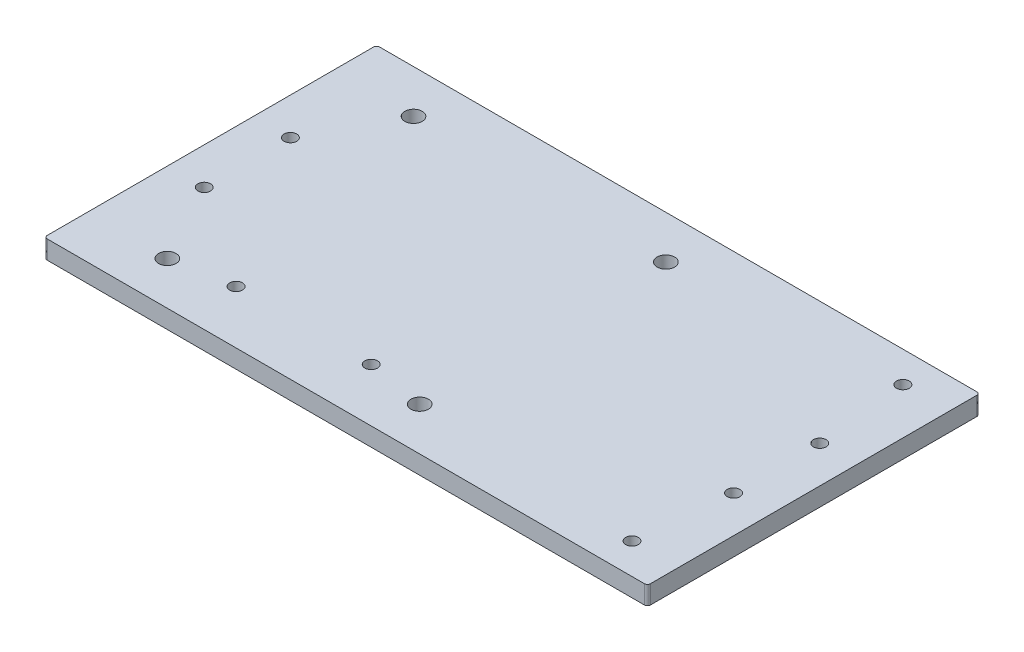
ISO-10303-21;
HEADER;
FILE_DESCRIPTION(('STEP AP214'),'2;1');
FILE_NAME('part.step','',(''),(''),'','','');
FILE_SCHEMA(('AUTOMOTIVE_DESIGN { 1 0 10303 214 1 1 1 1 }'));
ENDSEC;
DATA;
#1=APPLICATION_CONTEXT('core data for automotive mechanical design processes');
#2=APPLICATION_PROTOCOL_DEFINITION('international standard','automotive_design',2000,#1);
#3=PRODUCT_CONTEXT('',#1,'mechanical');
#4=PRODUCT('Part','Part','',(#3));
#5=PRODUCT_RELATED_PRODUCT_CATEGORY('part','',(#4));
#6=PRODUCT_DEFINITION_FORMATION('','',#4);
#7=PRODUCT_DEFINITION_CONTEXT('part definition',#1,'design');
#8=PRODUCT_DEFINITION('design','',#6,#7);
#9=PRODUCT_DEFINITION_SHAPE('','',#8);
#10=(LENGTH_UNIT() NAMED_UNIT(*) SI_UNIT(.MILLI.,.METRE.));
#11=(NAMED_UNIT(*) PLANE_ANGLE_UNIT() SI_UNIT($,.RADIAN.));
#12=(NAMED_UNIT(*) SI_UNIT($,.STERADIAN.) SOLID_ANGLE_UNIT());
#13=UNCERTAINTY_MEASURE_WITH_UNIT(LENGTH_MEASURE(1.E-05),#10,'distance_accuracy_value','');
#14=(GEOMETRIC_REPRESENTATION_CONTEXT(3) GLOBAL_UNCERTAINTY_ASSIGNED_CONTEXT((#13)) GLOBAL_UNIT_ASSIGNED_CONTEXT((#10,
#11,#12)) REPRESENTATION_CONTEXT('',''));
#15=CARTESIAN_POINT('',(0.,0.,0.));
#16=DIRECTION('',(0.,0.,1.));
#17=DIRECTION('',(1.,0.,0.));
#18=AXIS2_PLACEMENT_3D('',#15,#16,#17);
#19=CARTESIAN_POINT('',(49.,3.,-27.));
#20=DIRECTION('',(-1.,0.,0.));
#21=DIRECTION('',(0.,0.,1.));
#22=AXIS2_PLACEMENT_3D('',#19,#20,#21);
#23=PLANE('',#22);
#24=DIRECTION('',(0.,0.,-1.));
#25=VECTOR('',#24,1.);
#26=CARTESIAN_POINT('',(49.,0.,-27.));
#27=LINE('',#26,#25);
#28=CARTESIAN_POINT('',(49.,0.,26.5));
#29=VERTEX_POINT('',#28);
#30=CARTESIAN_POINT('',(49.,0.,-26.5));
#31=VERTEX_POINT('',#30);
#32=EDGE_CURVE('E137',#29,#31,#27,.T.);
#33=ORIENTED_EDGE('',*,*,#32,.T.);
#34=DIRECTION('',(0.,-1.,0.));
#35=VECTOR('',#34,1.);
#36=CARTESIAN_POINT('',(49.,3.,-26.5));
#37=LINE('',#36,#35);
#38=CARTESIAN_POINT('',(49.,3.,-26.5));
#39=VERTEX_POINT('',#38);
#40=EDGE_CURVE('E112',#31,#39,#37,.F.);
#41=ORIENTED_EDGE('',*,*,#40,.T.);
#42=DIRECTION('',(0.,0.,-1.));
#43=VECTOR('',#42,1.);
#44=CARTESIAN_POINT('',(49.,3.,-27.));
#45=LINE('',#44,#43);
#46=CARTESIAN_POINT('',(49.,3.,26.5));
#47=VERTEX_POINT('',#46);
#48=EDGE_CURVE('E150',#47,#39,#45,.T.);
#49=ORIENTED_EDGE('',*,*,#48,.F.);
#50=DIRECTION('',(0.,-1.,0.));
#51=VECTOR('',#50,1.);
#52=CARTESIAN_POINT('',(49.,3.,26.5));
#53=LINE('',#52,#51);
#54=EDGE_CURVE('E118',#47,#29,#53,.T.);
#55=ORIENTED_EDGE('',*,*,#54,.T.);
#56=EDGE_LOOP('',(#33,#41,#49,#55));
#57=FACE_BOUND('',#56,.T.);
#58=ADVANCED_FACE('F40',(#57),#23,.F.);
#59=CARTESIAN_POINT('',(-49.,3.,-27.));
#60=DIRECTION('',(0.,0.,1.));
#61=DIRECTION('',(1.,0.,0.));
#62=AXIS2_PLACEMENT_3D('',#59,#60,#61);
#63=PLANE('',#62);
#64=DIRECTION('',(-1.,0.,0.));
#65=VECTOR('',#64,1.);
#66=CARTESIAN_POINT('',(-49.,3.,-27.));
#67=LINE('',#66,#65);
#68=CARTESIAN_POINT('',(48.5,3.,-27.));
#69=VERTEX_POINT('',#68);
#70=CARTESIAN_POINT('',(-48.5,3.,-27.));
#71=VERTEX_POINT('',#70);
#72=EDGE_CURVE('E128',#69,#71,#67,.T.);
#73=ORIENTED_EDGE('',*,*,#72,.F.);
#74=DIRECTION('',(0.,-1.,0.));
#75=VECTOR('',#74,1.);
#76=CARTESIAN_POINT('',(48.5,3.,-27.));
#77=LINE('',#76,#75);
#78=CARTESIAN_POINT('',(48.5,0.,-27.));
#79=VERTEX_POINT('',#78);
#80=EDGE_CURVE('E111',#69,#79,#77,.T.);
#81=ORIENTED_EDGE('',*,*,#80,.T.);
#82=DIRECTION('',(-1.,0.,0.));
#83=VECTOR('',#82,1.);
#84=CARTESIAN_POINT('',(-49.,0.,-27.));
#85=LINE('',#84,#83);
#86=CARTESIAN_POINT('',(-48.5,0.,-27.));
#87=VERTEX_POINT('',#86);
#88=EDGE_CURVE('E125',#79,#87,#85,.T.);
#89=ORIENTED_EDGE('',*,*,#88,.T.);
#90=DIRECTION('',(0.,-1.,0.));
#91=VECTOR('',#90,1.);
#92=CARTESIAN_POINT('',(-48.5,3.,-27.));
#93=LINE('',#92,#91);
#94=EDGE_CURVE('E131',#87,#71,#93,.F.);
#95=ORIENTED_EDGE('',*,*,#94,.T.);
#96=EDGE_LOOP('',(#73,#81,#89,#95));
#97=FACE_BOUND('',#96,.T.);
#98=ADVANCED_FACE('F124',(#97),#63,.F.);
#99=CARTESIAN_POINT('',(-49.,3.,-27.));
#100=DIRECTION('',(1.,0.,0.));
#101=DIRECTION('',(0.,0.,-1.));
#102=AXIS2_PLACEMENT_3D('',#99,#100,#101);
#103=PLANE('',#102);
#104=DIRECTION('',(0.,0.,1.));
#105=VECTOR('',#104,1.);
#106=CARTESIAN_POINT('',(-49.,0.,-27.));
#107=LINE('',#106,#105);
#108=CARTESIAN_POINT('',(-49.,0.,-26.5));
#109=VERTEX_POINT('',#108);
#110=CARTESIAN_POINT('',(-49.,0.,26.5));
#111=VERTEX_POINT('',#110);
#112=EDGE_CURVE('E136',#109,#111,#107,.T.);
#113=ORIENTED_EDGE('',*,*,#112,.T.);
#114=DIRECTION('',(0.,-1.,0.));
#115=VECTOR('',#114,1.);
#116=CARTESIAN_POINT('',(-49.,3.,26.5));
#117=LINE('',#116,#115);
#118=CARTESIAN_POINT('',(-49.,3.,26.5));
#119=VERTEX_POINT('',#118);
#120=EDGE_CURVE('E11',#111,#119,#117,.F.);
#121=ORIENTED_EDGE('',*,*,#120,.T.);
#122=DIRECTION('',(0.,0.,1.));
#123=VECTOR('',#122,1.);
#124=CARTESIAN_POINT('',(-49.,3.,-27.));
#125=LINE('',#124,#123);
#126=CARTESIAN_POINT('',(-49.,3.,-26.5));
#127=VERTEX_POINT('',#126);
#128=EDGE_CURVE('E207',#127,#119,#125,.T.);
#129=ORIENTED_EDGE('',*,*,#128,.F.);
#130=DIRECTION('',(0.,-1.,0.));
#131=VECTOR('',#130,1.);
#132=CARTESIAN_POINT('',(-49.,3.,-26.5));
#133=LINE('',#132,#131);
#134=EDGE_CURVE('E49',#127,#109,#133,.T.);
#135=ORIENTED_EDGE('',*,*,#134,.T.);
#136=EDGE_LOOP('',(#113,#121,#129,#135));
#137=FACE_BOUND('',#136,.T.);
#138=ADVANCED_FACE('F205',(#137),#103,.F.);
#139=CARTESIAN_POINT('',(-49.,3.,27.));
#140=DIRECTION('',(0.,0.,-1.));
#141=DIRECTION('',(-1.,0.,0.));
#142=AXIS2_PLACEMENT_3D('',#139,#140,#141);
#143=PLANE('',#142);
#144=DIRECTION('',(1.,0.,0.));
#145=VECTOR('',#144,1.);
#146=CARTESIAN_POINT('',(-49.,0.,27.));
#147=LINE('',#146,#145);
#148=CARTESIAN_POINT('',(-48.5,0.,27.));
#149=VERTEX_POINT('',#148);
#150=CARTESIAN_POINT('',(48.5,0.,27.));
#151=VERTEX_POINT('',#150);
#152=EDGE_CURVE('E142',#149,#151,#147,.T.);
#153=ORIENTED_EDGE('',*,*,#152,.T.);
#154=DIRECTION('',(0.,-1.,0.));
#155=VECTOR('',#154,1.);
#156=CARTESIAN_POINT('',(48.5,3.,27.));
#157=LINE('',#156,#155);
#158=CARTESIAN_POINT('',(48.5,3.,27.));
#159=VERTEX_POINT('',#158);
#160=EDGE_CURVE('E56',#151,#159,#157,.F.);
#161=ORIENTED_EDGE('',*,*,#160,.T.);
#162=DIRECTION('',(1.,0.,0.));
#163=VECTOR('',#162,1.);
#164=CARTESIAN_POINT('',(-49.,3.,27.));
#165=LINE('',#164,#163);
#166=CARTESIAN_POINT('',(-48.5,3.,27.));
#167=VERTEX_POINT('',#166);
#168=EDGE_CURVE('E170',#167,#159,#165,.T.);
#169=ORIENTED_EDGE('',*,*,#168,.F.);
#170=DIRECTION('',(0.,-1.,0.));
#171=VECTOR('',#170,1.);
#172=CARTESIAN_POINT('',(-48.5,3.,27.));
#173=LINE('',#172,#171);
#174=EDGE_CURVE('E195',#167,#149,#173,.T.);
#175=ORIENTED_EDGE('',*,*,#174,.T.);
#176=EDGE_LOOP('',(#153,#161,#169,#175));
#177=FACE_BOUND('',#176,.T.);
#178=ADVANCED_FACE('F214',(#177),#143,.F.);
#179=CARTESIAN_POINT('',(0.,3.,0.));
#180=DIRECTION('',(0.,1.,0.));
#181=DIRECTION('',(0.,0.,1.));
#182=AXIS2_PLACEMENT_3D('',#179,#180,#181);
#183=PLANE('',#182);
#184=CARTESIAN_POINT('',(43.,3.,-7.));
#185=DIRECTION('',(0.,1.,0.));
#186=DIRECTION('',(0.,0.,1.));
#187=AXIS2_PLACEMENT_3D('',#184,#185,#186);
#188=CIRCLE('',#187,1.03);
#189=CARTESIAN_POINT('',(43.,3.,-5.97));
#190=VERTEX_POINT('',#189);
#191=EDGE_CURVE('E291',#190,#190,#188,.T.);
#192=ORIENTED_EDGE('',*,*,#191,.F.);
#193=EDGE_LOOP('',(#192));
#194=FACE_BOUND('',#193,.T.);
#195=CARTESIAN_POINT('',(-43.,3.,7.));
#196=DIRECTION('',(0.,1.,0.));
#197=DIRECTION('',(0.,0.,-1.));
#198=AXIS2_PLACEMENT_3D('',#195,#196,#197);
#199=CIRCLE('',#198,1.03);
#200=CARTESIAN_POINT('',(-43.,3.,5.97));
#201=VERTEX_POINT('',#200);
#202=EDGE_CURVE('E295',#201,#201,#199,.T.);
#203=ORIENTED_EDGE('',*,*,#202,.F.);
#204=EDGE_LOOP('',(#203));
#205=FACE_BOUND('',#204,.T.);
#206=CARTESIAN_POINT('',(-43.,3.,-7.));
#207=DIRECTION('',(0.,1.,0.));
#208=DIRECTION('',(0.,0.,1.));
#209=AXIS2_PLACEMENT_3D('',#206,#207,#208);
#210=CIRCLE('',#209,1.03);
#211=CARTESIAN_POINT('',(-43.,3.,-5.97));
#212=VERTEX_POINT('',#211);
#213=EDGE_CURVE('E290',#212,#212,#210,.T.);
#214=ORIENTED_EDGE('',*,*,#213,.F.);
#215=EDGE_LOOP('',(#214));
#216=FACE_BOUND('',#215,.T.);
#217=CARTESIAN_POINT('',(43.,3.,7.));
#218=DIRECTION('',(0.,1.,0.));
#219=DIRECTION('',(0.,0.,-1.));
#220=AXIS2_PLACEMENT_3D('',#217,#218,#219);
#221=CIRCLE('',#220,1.03);
#222=CARTESIAN_POINT('',(43.,3.,5.97));
#223=VERTEX_POINT('',#222);
#224=EDGE_CURVE('E156',#223,#223,#221,.T.);
#225=ORIENTED_EDGE('',*,*,#224,.F.);
#226=EDGE_LOOP('',(#225));
#227=FACE_BOUND('',#226,.T.);
#228=CARTESIAN_POINT('',(-4.52499999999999,3.,18.35));
#229=DIRECTION('',(0.,1.,0.));
#230=DIRECTION('',(0.,0.,1.));
#231=AXIS2_PLACEMENT_3D('',#228,#229,#230);
#232=CIRCLE('',#231,1.03);
#233=CARTESIAN_POINT('',(-4.52499999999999,3.,19.38));
#234=VERTEX_POINT('',#233);
#235=EDGE_CURVE('E280',#234,#234,#232,.T.);
#236=ORIENTED_EDGE('',*,*,#235,.F.);
#237=EDGE_LOOP('',(#236));
#238=FACE_BOUND('',#237,.T.);
#239=CARTESIAN_POINT('',(-26.475,3.,18.35));
#240=DIRECTION('',(0.,1.,0.));
#241=DIRECTION('',(0.,0.,-1.));
#242=AXIS2_PLACEMENT_3D('',#239,#240,#241);
#243=CIRCLE('',#242,1.03);
#244=CARTESIAN_POINT('',(-26.475,3.,17.32));
#245=VERTEX_POINT('',#244);
#246=EDGE_CURVE('E168',#245,#245,#243,.T.);
#247=ORIENTED_EDGE('',*,*,#246,.F.);
#248=EDGE_LOOP('',(#247));
#249=FACE_BOUND('',#248,.T.);
#250=CARTESIAN_POINT('',(-36.,3.,20.));
#251=DIRECTION('',(0.,1.,0.));
#252=DIRECTION('',(0.,0.,1.));
#253=AXIS2_PLACEMENT_3D('',#250,#251,#252);
#254=CIRCLE('',#253,1.42);
#255=CARTESIAN_POINT('',(-36.,3.,21.42));
#256=VERTEX_POINT('',#255);
#257=EDGE_CURVE('E258',#256,#256,#254,.T.);
#258=ORIENTED_EDGE('',*,*,#257,.F.);
#259=EDGE_LOOP('',(#258));
#260=FACE_BOUND('',#259,.T.);
#261=CARTESIAN_POINT('',(5.00000000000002,3.,-20.));
#262=DIRECTION('',(0.,1.,0.));
#263=DIRECTION('',(0.,0.,-1.));
#264=AXIS2_PLACEMENT_3D('',#261,#262,#263);
#265=CIRCLE('',#264,1.42);
#266=CARTESIAN_POINT('',(5.00000000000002,3.,-21.42));
#267=VERTEX_POINT('',#266);
#268=EDGE_CURVE('E249',#267,#267,#265,.T.);
#269=ORIENTED_EDGE('',*,*,#268,.F.);
#270=EDGE_LOOP('',(#269));
#271=FACE_BOUND('',#270,.T.);
#272=CARTESIAN_POINT('',(-36.,3.,-20.));
#273=DIRECTION('',(0.,1.,0.));
#274=DIRECTION('',(0.,0.,-1.));
#275=AXIS2_PLACEMENT_3D('',#272,#273,#274);
#276=CIRCLE('',#275,1.42);
#277=CARTESIAN_POINT('',(-36.,3.,-21.42));
#278=VERTEX_POINT('',#277);
#279=EDGE_CURVE('E265',#278,#278,#276,.T.);
#280=ORIENTED_EDGE('',*,*,#279,.F.);
#281=EDGE_LOOP('',(#280));
#282=FACE_BOUND('',#281,.T.);
#283=CARTESIAN_POINT('',(5.00000000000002,3.,20.));
#284=DIRECTION('',(0.,1.,0.));
#285=DIRECTION('',(0.,0.,1.));
#286=AXIS2_PLACEMENT_3D('',#283,#284,#285);
#287=CIRCLE('',#286,1.42);
#288=CARTESIAN_POINT('',(5.00000000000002,3.,21.42));
#289=VERTEX_POINT('',#288);
#290=EDGE_CURVE('E241',#289,#289,#287,.T.);
#291=ORIENTED_EDGE('',*,*,#290,.F.);
#292=EDGE_LOOP('',(#291));
#293=FACE_BOUND('',#292,.T.);
#294=CARTESIAN_POINT('',(41.5,3.,-22.));
#295=DIRECTION('',(0.,1.,0.));
#296=DIRECTION('',(0.,0.,1.));
#297=AXIS2_PLACEMENT_3D('',#294,#295,#296);
#298=CIRCLE('',#297,1.03);
#299=CARTESIAN_POINT('',(41.5,3.,-20.97));
#300=VERTEX_POINT('',#299);
#301=EDGE_CURVE('E234',#300,#300,#298,.T.);
#302=ORIENTED_EDGE('',*,*,#301,.F.);
#303=EDGE_LOOP('',(#302));
#304=FACE_BOUND('',#303,.T.);
#305=CARTESIAN_POINT('',(41.5,3.,22.));
#306=DIRECTION('',(0.,1.,0.));
#307=DIRECTION('',(0.,0.,-1.));
#308=AXIS2_PLACEMENT_3D('',#305,#306,#307);
#309=CIRCLE('',#308,1.03);
#310=CARTESIAN_POINT('',(41.5,3.,20.97));
#311=VERTEX_POINT('',#310);
#312=EDGE_CURVE('E225',#311,#311,#309,.T.);
#313=ORIENTED_EDGE('',*,*,#312,.F.);
#314=EDGE_LOOP('',(#313));
#315=FACE_BOUND('',#314,.T.);
#316=ORIENTED_EDGE('',*,*,#48,.T.);
#317=CARTESIAN_POINT('',(48.5,3.,-26.5));
#318=DIRECTION('',(0.,1.,0.));
#319=DIRECTION('',(0.,0.,1.));
#320=AXIS2_PLACEMENT_3D('',#317,#318,#319);
#321=CIRCLE('',#320,0.5);
#322=EDGE_CURVE('E192',#39,#69,#321,.T.);
#323=ORIENTED_EDGE('',*,*,#322,.T.);
#324=ORIENTED_EDGE('',*,*,#72,.T.);
#325=CARTESIAN_POINT('',(-48.5,3.,-26.5));
#326=DIRECTION('',(0.,1.,0.));
#327=DIRECTION('',(0.,0.,1.));
#328=AXIS2_PLACEMENT_3D('',#325,#326,#327);
#329=CIRCLE('',#328,0.5);
#330=EDGE_CURVE('E184',#71,#127,#329,.T.);
#331=ORIENTED_EDGE('',*,*,#330,.T.);
#332=ORIENTED_EDGE('',*,*,#128,.T.);
#333=CARTESIAN_POINT('',(-48.5,3.,26.5));
#334=DIRECTION('',(0.,1.,0.));
#335=DIRECTION('',(0.,0.,1.));
#336=AXIS2_PLACEMENT_3D('',#333,#334,#335);
#337=CIRCLE('',#336,0.5);
#338=EDGE_CURVE('E63',#119,#167,#337,.T.);
#339=ORIENTED_EDGE('',*,*,#338,.T.);
#340=ORIENTED_EDGE('',*,*,#168,.T.);
#341=CARTESIAN_POINT('',(48.5,3.,26.5));
#342=DIRECTION('',(0.,1.,0.));
#343=DIRECTION('',(0.,0.,1.));
#344=AXIS2_PLACEMENT_3D('',#341,#342,#343);
#345=CIRCLE('',#344,0.5);
#346=EDGE_CURVE('E189',#159,#47,#345,.T.);
#347=ORIENTED_EDGE('',*,*,#346,.T.);
#348=EDGE_LOOP('',(#316,#323,#324,#331,#332,#339,#340,#347));
#349=FACE_BOUND('',#348,.T.);
#350=ADVANCED_FACE('F306',(#194,#205,#216,#227,#238,#249,#260,#271,#282,#293,#304,#315,#349),
#183,.T.);
#351=CARTESIAN_POINT('',(0.,0.,0.));
#352=DIRECTION('',(0.,1.,0.));
#353=DIRECTION('',(0.,0.,1.));
#354=AXIS2_PLACEMENT_3D('',#351,#352,#353);
#355=PLANE('',#354);
#356=CARTESIAN_POINT('',(43.,0.,-7.));
#357=DIRECTION('',(0.,1.,0.));
#358=DIRECTION('',(0.,0.,1.));
#359=AXIS2_PLACEMENT_3D('',#356,#357,#358);
#360=CIRCLE('',#359,1.03);
#361=CARTESIAN_POINT('',(43.,0.,-5.97));
#362=VERTEX_POINT('',#361);
#363=EDGE_CURVE('E164',#362,#362,#360,.T.);
#364=ORIENTED_EDGE('',*,*,#363,.T.);
#365=EDGE_LOOP('',(#364));
#366=FACE_BOUND('',#365,.T.);
#367=CARTESIAN_POINT('',(-43.,0.,7.));
#368=DIRECTION('',(0.,1.,0.));
#369=DIRECTION('',(0.,0.,1.));
#370=AXIS2_PLACEMENT_3D('',#367,#368,#369);
#371=CIRCLE('',#370,1.03);
#372=CARTESIAN_POINT('',(-43.,0.,8.03));
#373=VERTEX_POINT('',#372);
#374=EDGE_CURVE('E160',#373,#373,#371,.T.);
#375=ORIENTED_EDGE('',*,*,#374,.T.);
#376=EDGE_LOOP('',(#375));
#377=FACE_BOUND('',#376,.T.);
#378=CARTESIAN_POINT('',(-43.,0.,-7.));
#379=DIRECTION('',(0.,1.,0.));
#380=DIRECTION('',(0.,0.,1.));
#381=AXIS2_PLACEMENT_3D('',#378,#379,#380);
#382=CIRCLE('',#381,1.03);
#383=CARTESIAN_POINT('',(-43.,0.,-5.97));
#384=VERTEX_POINT('',#383);
#385=EDGE_CURVE('E155',#384,#384,#382,.T.);
#386=ORIENTED_EDGE('',*,*,#385,.T.);
#387=EDGE_LOOP('',(#386));
#388=FACE_BOUND('',#387,.T.);
#389=CARTESIAN_POINT('',(43.,0.,7.));
#390=DIRECTION('',(0.,1.,0.));
#391=DIRECTION('',(0.,0.,1.));
#392=AXIS2_PLACEMENT_3D('',#389,#390,#391);
#393=CIRCLE('',#392,1.03);
#394=CARTESIAN_POINT('',(43.,0.,8.03));
#395=VERTEX_POINT('',#394);
#396=EDGE_CURVE('E151',#395,#395,#393,.T.);
#397=ORIENTED_EDGE('',*,*,#396,.T.);
#398=EDGE_LOOP('',(#397));
#399=FACE_BOUND('',#398,.T.);
#400=CARTESIAN_POINT('',(-4.52499999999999,0.,18.35));
#401=DIRECTION('',(0.,1.,0.));
#402=DIRECTION('',(0.,0.,1.));
#403=AXIS2_PLACEMENT_3D('',#400,#401,#402);
#404=CIRCLE('',#403,1.03);
#405=CARTESIAN_POINT('',(-4.52499999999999,0.,19.38));
#406=VERTEX_POINT('',#405);
#407=EDGE_CURVE('E269',#406,#406,#404,.T.);
#408=ORIENTED_EDGE('',*,*,#407,.T.);
#409=EDGE_LOOP('',(#408));
#410=FACE_BOUND('',#409,.T.);
#411=CARTESIAN_POINT('',(-26.475,0.,18.35));
#412=DIRECTION('',(0.,1.,0.));
#413=DIRECTION('',(0.,0.,-1.));
#414=AXIS2_PLACEMENT_3D('',#411,#412,#413);
#415=CIRCLE('',#414,1.03);
#416=CARTESIAN_POINT('',(-26.475,0.,17.32));
#417=VERTEX_POINT('',#416);
#418=EDGE_CURVE('E276',#417,#417,#415,.T.);
#419=ORIENTED_EDGE('',*,*,#418,.T.);
#420=EDGE_LOOP('',(#419));
#421=FACE_BOUND('',#420,.T.);
#422=CARTESIAN_POINT('',(-36.,0.,20.));
#423=DIRECTION('',(0.,1.,0.));
#424=DIRECTION('',(0.,0.,1.));
#425=AXIS2_PLACEMENT_3D('',#422,#423,#424);
#426=CIRCLE('',#425,1.42);
#427=CARTESIAN_POINT('',(-36.,0.,21.42));
#428=VERTEX_POINT('',#427);
#429=EDGE_CURVE('E245',#428,#428,#426,.T.);
#430=ORIENTED_EDGE('',*,*,#429,.T.);
#431=EDGE_LOOP('',(#430));
#432=FACE_BOUND('',#431,.T.);
#433=CARTESIAN_POINT('',(5.00000000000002,0.,-20.));
#434=DIRECTION('',(0.,1.,0.));
#435=DIRECTION('',(0.,0.,-1.));
#436=AXIS2_PLACEMENT_3D('',#433,#434,#435);
#437=CIRCLE('',#436,1.42);
#438=CARTESIAN_POINT('',(5.00000000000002,0.,-21.42));
#439=VERTEX_POINT('',#438);
#440=EDGE_CURVE('E253',#439,#439,#437,.T.);
#441=ORIENTED_EDGE('',*,*,#440,.T.);
#442=EDGE_LOOP('',(#441));
#443=FACE_BOUND('',#442,.T.);
#444=CARTESIAN_POINT('',(-36.,0.,-20.));
#445=DIRECTION('',(0.,1.,0.));
#446=DIRECTION('',(0.,0.,-1.));
#447=AXIS2_PLACEMENT_3D('',#444,#445,#446);
#448=CIRCLE('',#447,1.42);
#449=CARTESIAN_POINT('',(-36.,0.,-21.42));
#450=VERTEX_POINT('',#449);
#451=EDGE_CURVE('E254',#450,#450,#448,.T.);
#452=ORIENTED_EDGE('',*,*,#451,.T.);
#453=EDGE_LOOP('',(#452));
#454=FACE_BOUND('',#453,.T.);
#455=CARTESIAN_POINT('',(5.00000000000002,0.,20.));
#456=DIRECTION('',(0.,1.,0.));
#457=DIRECTION('',(0.,0.,1.));
#458=AXIS2_PLACEMENT_3D('',#455,#456,#457);
#459=CIRCLE('',#458,1.42);
#460=CARTESIAN_POINT('',(5.00000000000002,0.,21.42));
#461=VERTEX_POINT('',#460);
#462=EDGE_CURVE('E230',#461,#461,#459,.T.);
#463=ORIENTED_EDGE('',*,*,#462,.T.);
#464=EDGE_LOOP('',(#463));
#465=FACE_BOUND('',#464,.T.);
#466=CARTESIAN_POINT('',(41.5,0.,-22.));
#467=DIRECTION('',(0.,1.,0.));
#468=DIRECTION('',(0.,0.,1.));
#469=AXIS2_PLACEMENT_3D('',#466,#467,#468);
#470=CIRCLE('',#469,1.03);
#471=CARTESIAN_POINT('',(41.5,0.,-20.97));
#472=VERTEX_POINT('',#471);
#473=EDGE_CURVE('E144',#472,#472,#470,.T.);
#474=ORIENTED_EDGE('',*,*,#473,.T.);
#475=EDGE_LOOP('',(#474));
#476=FACE_BOUND('',#475,.T.);
#477=CARTESIAN_POINT('',(41.5,0.,22.));
#478=DIRECTION('',(0.,1.,0.));
#479=DIRECTION('',(0.,0.,-1.));
#480=AXIS2_PLACEMENT_3D('',#477,#478,#479);
#481=CIRCLE('',#480,1.03);
#482=CARTESIAN_POINT('',(41.5,0.,20.97));
#483=VERTEX_POINT('',#482);
#484=EDGE_CURVE('E229',#483,#483,#481,.T.);
#485=ORIENTED_EDGE('',*,*,#484,.T.);
#486=EDGE_LOOP('',(#485));
#487=FACE_BOUND('',#486,.T.);
#488=ORIENTED_EDGE('',*,*,#88,.F.);
#489=CARTESIAN_POINT('',(48.5,0.,-26.5));
#490=DIRECTION('',(0.,1.,0.));
#491=DIRECTION('',(0.,0.,1.));
#492=AXIS2_PLACEMENT_3D('',#489,#490,#491);
#493=CIRCLE('',#492,0.5);
#494=EDGE_CURVE('E107',#79,#31,#493,.F.);
#495=ORIENTED_EDGE('',*,*,#494,.T.);
#496=ORIENTED_EDGE('',*,*,#32,.F.);
#497=CARTESIAN_POINT('',(48.5,0.,26.5));
#498=DIRECTION('',(0.,1.,0.));
#499=DIRECTION('',(0.,0.,1.));
#500=AXIS2_PLACEMENT_3D('',#497,#498,#499);
#501=CIRCLE('',#500,0.5);
#502=EDGE_CURVE('E119',#29,#151,#501,.F.);
#503=ORIENTED_EDGE('',*,*,#502,.T.);
#504=ORIENTED_EDGE('',*,*,#152,.F.);
#505=CARTESIAN_POINT('',(-48.5,0.,26.5));
#506=DIRECTION('',(0.,1.,0.));
#507=DIRECTION('',(0.,0.,1.));
#508=AXIS2_PLACEMENT_3D('',#505,#506,#507);
#509=CIRCLE('',#508,0.5);
#510=EDGE_CURVE('E174',#149,#111,#509,.F.);
#511=ORIENTED_EDGE('',*,*,#510,.T.);
#512=ORIENTED_EDGE('',*,*,#112,.F.);
#513=CARTESIAN_POINT('',(-48.5,0.,-26.5));
#514=DIRECTION('',(0.,1.,0.));
#515=DIRECTION('',(0.,0.,1.));
#516=AXIS2_PLACEMENT_3D('',#513,#514,#515);
#517=CIRCLE('',#516,0.5);
#518=EDGE_CURVE('E130',#109,#87,#517,.F.);
#519=ORIENTED_EDGE('',*,*,#518,.T.);
#520=EDGE_LOOP('',(#488,#495,#496,#503,#504,#511,#512,#519));
#521=FACE_BOUND('',#520,.T.);
#522=ADVANCED_FACE('F133',(#366,#377,#388,#399,#410,#421,#432,#443,#454,#465,#476,#487,#521),
#355,.F.);
#523=CARTESIAN_POINT('',(41.5,0.,22.));
#524=DIRECTION('',(0.,1.,0.));
#525=DIRECTION('',(0.,0.,1.));
#526=AXIS2_PLACEMENT_3D('',#523,#524,#525);
#527=CYLINDRICAL_SURFACE('',#526,1.03);
#528=ORIENTED_EDGE('',*,*,#484,.F.);
#529=EDGE_LOOP('',(#528));
#530=FACE_BOUND('',#529,.T.);
#531=ORIENTED_EDGE('',*,*,#312,.T.);
#532=EDGE_LOOP('',(#531));
#533=FACE_BOUND('',#532,.T.);
#534=ADVANCED_FACE('F353',(#530,#533),#527,.F.);
#535=CARTESIAN_POINT('',(41.5,0.,-22.));
#536=DIRECTION('',(0.,1.,0.));
#537=DIRECTION('',(0.,0.,1.));
#538=AXIS2_PLACEMENT_3D('',#535,#536,#537);
#539=CYLINDRICAL_SURFACE('',#538,1.03);
#540=ORIENTED_EDGE('',*,*,#473,.F.);
#541=EDGE_LOOP('',(#540));
#542=FACE_BOUND('',#541,.T.);
#543=ORIENTED_EDGE('',*,*,#301,.T.);
#544=EDGE_LOOP('',(#543));
#545=FACE_BOUND('',#544,.T.);
#546=ADVANCED_FACE('F358',(#542,#545),#539,.F.);
#547=CARTESIAN_POINT('',(5.00000000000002,0.,20.));
#548=DIRECTION('',(0.,1.,0.));
#549=DIRECTION('',(0.,0.,1.));
#550=AXIS2_PLACEMENT_3D('',#547,#548,#549);
#551=CYLINDRICAL_SURFACE('',#550,1.42);
#552=ORIENTED_EDGE('',*,*,#462,.F.);
#553=EDGE_LOOP('',(#552));
#554=FACE_BOUND('',#553,.T.);
#555=ORIENTED_EDGE('',*,*,#290,.T.);
#556=EDGE_LOOP('',(#555));
#557=FACE_BOUND('',#556,.T.);
#558=ADVANCED_FACE('F362',(#554,#557),#551,.F.);
#559=CARTESIAN_POINT('',(-36.,0.,-20.));
#560=DIRECTION('',(0.,1.,0.));
#561=DIRECTION('',(0.,0.,1.));
#562=AXIS2_PLACEMENT_3D('',#559,#560,#561);
#563=CYLINDRICAL_SURFACE('',#562,1.42);
#564=ORIENTED_EDGE('',*,*,#451,.F.);
#565=EDGE_LOOP('',(#564));
#566=FACE_BOUND('',#565,.T.);
#567=ORIENTED_EDGE('',*,*,#279,.T.);
#568=EDGE_LOOP('',(#567));
#569=FACE_BOUND('',#568,.T.);
#570=ADVANCED_FACE('F366',(#566,#569),#563,.F.);
#571=CARTESIAN_POINT('',(5.00000000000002,0.,-20.));
#572=DIRECTION('',(0.,1.,0.));
#573=DIRECTION('',(0.,0.,1.));
#574=AXIS2_PLACEMENT_3D('',#571,#572,#573);
#575=CYLINDRICAL_SURFACE('',#574,1.42);
#576=ORIENTED_EDGE('',*,*,#440,.F.);
#577=EDGE_LOOP('',(#576));
#578=FACE_BOUND('',#577,.T.);
#579=ORIENTED_EDGE('',*,*,#268,.T.);
#580=EDGE_LOOP('',(#579));
#581=FACE_BOUND('',#580,.T.);
#582=ADVANCED_FACE('F368',(#578,#581),#575,.F.);
#583=CARTESIAN_POINT('',(-36.,0.,20.));
#584=DIRECTION('',(0.,1.,0.));
#585=DIRECTION('',(0.,0.,1.));
#586=AXIS2_PLACEMENT_3D('',#583,#584,#585);
#587=CYLINDRICAL_SURFACE('',#586,1.42);
#588=ORIENTED_EDGE('',*,*,#429,.F.);
#589=EDGE_LOOP('',(#588));
#590=FACE_BOUND('',#589,.T.);
#591=ORIENTED_EDGE('',*,*,#257,.T.);
#592=EDGE_LOOP('',(#591));
#593=FACE_BOUND('',#592,.T.);
#594=ADVANCED_FACE('F371',(#590,#593),#587,.F.);
#595=CARTESIAN_POINT('',(-26.475,0.,18.35));
#596=DIRECTION('',(0.,1.,0.));
#597=DIRECTION('',(0.,0.,1.));
#598=AXIS2_PLACEMENT_3D('',#595,#596,#597);
#599=CYLINDRICAL_SURFACE('',#598,1.03);
#600=ORIENTED_EDGE('',*,*,#418,.F.);
#601=EDGE_LOOP('',(#600));
#602=FACE_BOUND('',#601,.T.);
#603=ORIENTED_EDGE('',*,*,#246,.T.);
#604=EDGE_LOOP('',(#603));
#605=FACE_BOUND('',#604,.T.);
#606=ADVANCED_FACE('F375',(#602,#605),#599,.F.);
#607=CARTESIAN_POINT('',(-4.52499999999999,0.,18.35));
#608=DIRECTION('',(0.,1.,0.));
#609=DIRECTION('',(0.,0.,1.));
#610=AXIS2_PLACEMENT_3D('',#607,#608,#609);
#611=CYLINDRICAL_SURFACE('',#610,1.03);
#612=ORIENTED_EDGE('',*,*,#407,.F.);
#613=EDGE_LOOP('',(#612));
#614=FACE_BOUND('',#613,.T.);
#615=ORIENTED_EDGE('',*,*,#235,.T.);
#616=EDGE_LOOP('',(#615));
#617=FACE_BOUND('',#616,.T.);
#618=ADVANCED_FACE('F382',(#614,#617),#611,.F.);
#619=CARTESIAN_POINT('',(43.,-7.,7.));
#620=DIRECTION('',(0.,1.,0.));
#621=DIRECTION('',(0.,0.,1.));
#622=AXIS2_PLACEMENT_3D('',#619,#620,#621);
#623=CYLINDRICAL_SURFACE('',#622,1.03);
#624=ORIENTED_EDGE('',*,*,#224,.T.);
#625=EDGE_LOOP('',(#624));
#626=FACE_BOUND('',#625,.T.);
#627=ORIENTED_EDGE('',*,*,#396,.F.);
#628=EDGE_LOOP('',(#627));
#629=FACE_BOUND('',#628,.T.);
#630=ADVANCED_FACE('F386',(#626,#629),#623,.F.);
#631=CARTESIAN_POINT('',(-43.,-7.,-7.));
#632=DIRECTION('',(0.,1.,0.));
#633=DIRECTION('',(0.,0.,1.));
#634=AXIS2_PLACEMENT_3D('',#631,#632,#633);
#635=CYLINDRICAL_SURFACE('',#634,1.03);
#636=ORIENTED_EDGE('',*,*,#213,.T.);
#637=EDGE_LOOP('',(#636));
#638=FACE_BOUND('',#637,.T.);
#639=ORIENTED_EDGE('',*,*,#385,.F.);
#640=EDGE_LOOP('',(#639));
#641=FACE_BOUND('',#640,.T.);
#642=ADVANCED_FACE('F303',(#638,#641),#635,.F.);
#643=CARTESIAN_POINT('',(-43.,-7.,7.));
#644=DIRECTION('',(0.,1.,0.));
#645=DIRECTION('',(0.,0.,1.));
#646=AXIS2_PLACEMENT_3D('',#643,#644,#645);
#647=CYLINDRICAL_SURFACE('',#646,1.03);
#648=ORIENTED_EDGE('',*,*,#202,.T.);
#649=EDGE_LOOP('',(#648));
#650=FACE_BOUND('',#649,.T.);
#651=ORIENTED_EDGE('',*,*,#374,.F.);
#652=EDGE_LOOP('',(#651));
#653=FACE_BOUND('',#652,.T.);
#654=ADVANCED_FACE('F393',(#650,#653),#647,.F.);
#655=CARTESIAN_POINT('',(43.,-7.,-7.));
#656=DIRECTION('',(0.,1.,0.));
#657=DIRECTION('',(0.,0.,1.));
#658=AXIS2_PLACEMENT_3D('',#655,#656,#657);
#659=CYLINDRICAL_SURFACE('',#658,1.03);
#660=ORIENTED_EDGE('',*,*,#191,.T.);
#661=EDGE_LOOP('',(#660));
#662=FACE_BOUND('',#661,.T.);
#663=ORIENTED_EDGE('',*,*,#363,.F.);
#664=EDGE_LOOP('',(#663));
#665=FACE_BOUND('',#664,.T.);
#666=ADVANCED_FACE('F339',(#662,#665),#659,.F.);
#667=CARTESIAN_POINT('',(48.5,3.,-26.5));
#668=DIRECTION('',(0.,-1.,0.));
#669=DIRECTION('',(0.,0.,-1.));
#670=AXIS2_PLACEMENT_3D('',#667,#668,#669);
#671=CYLINDRICAL_SURFACE('',#670,0.5);
#672=ORIENTED_EDGE('',*,*,#322,.F.);
#673=ORIENTED_EDGE('',*,*,#40,.F.);
#674=ORIENTED_EDGE('',*,*,#494,.F.);
#675=ORIENTED_EDGE('',*,*,#80,.F.);
#676=EDGE_LOOP('',(#672,#673,#674,#675));
#677=FACE_BOUND('',#676,.T.);
#678=ADVANCED_FACE('F110',(#677),#671,.T.);
#679=CARTESIAN_POINT('',(48.5,3.,26.5));
#680=DIRECTION('',(0.,-1.,0.));
#681=DIRECTION('',(0.,0.,-1.));
#682=AXIS2_PLACEMENT_3D('',#679,#680,#681);
#683=CYLINDRICAL_SURFACE('',#682,0.5);
#684=ORIENTED_EDGE('',*,*,#346,.F.);
#685=ORIENTED_EDGE('',*,*,#160,.F.);
#686=ORIENTED_EDGE('',*,*,#502,.F.);
#687=ORIENTED_EDGE('',*,*,#54,.F.);
#688=EDGE_LOOP('',(#684,#685,#686,#687));
#689=FACE_BOUND('',#688,.T.);
#690=ADVANCED_FACE('F332',(#689),#683,.T.);
#691=CARTESIAN_POINT('',(-48.5,3.,26.5));
#692=DIRECTION('',(0.,-1.,0.));
#693=DIRECTION('',(0.,0.,-1.));
#694=AXIS2_PLACEMENT_3D('',#691,#692,#693);
#695=CYLINDRICAL_SURFACE('',#694,0.5);
#696=ORIENTED_EDGE('',*,*,#338,.F.);
#697=ORIENTED_EDGE('',*,*,#120,.F.);
#698=ORIENTED_EDGE('',*,*,#510,.F.);
#699=ORIENTED_EDGE('',*,*,#174,.F.);
#700=EDGE_LOOP('',(#696,#697,#698,#699));
#701=FACE_BOUND('',#700,.T.);
#702=ADVANCED_FACE('F213',(#701),#695,.T.);
#703=CARTESIAN_POINT('',(-48.5,3.,-26.5));
#704=DIRECTION('',(0.,-1.,0.));
#705=DIRECTION('',(0.,0.,-1.));
#706=AXIS2_PLACEMENT_3D('',#703,#704,#705);
#707=CYLINDRICAL_SURFACE('',#706,0.5);
#708=ORIENTED_EDGE('',*,*,#330,.F.);
#709=ORIENTED_EDGE('',*,*,#94,.F.);
#710=ORIENTED_EDGE('',*,*,#518,.F.);
#711=ORIENTED_EDGE('',*,*,#134,.F.);
#712=EDGE_LOOP('',(#708,#709,#710,#711));
#713=FACE_BOUND('',#712,.T.);
#714=ADVANCED_FACE('F42',(#713),#707,.T.);
#715=CLOSED_SHELL('',(#58,#98,#138,#178,#350,#522,#534,#546,#558,#570,#582,#594,#606,#618,#630,
#642,#654,#666,#678,#690,#702,#714));
#716=MANIFOLD_SOLID_BREP('B2',#715);
#717=ADVANCED_BREP_SHAPE_REPRESENTATION('',(#18,#716),#14);
#718=SHAPE_DEFINITION_REPRESENTATION(#9,#717);
ENDSEC;
END-ISO-10303-21;
